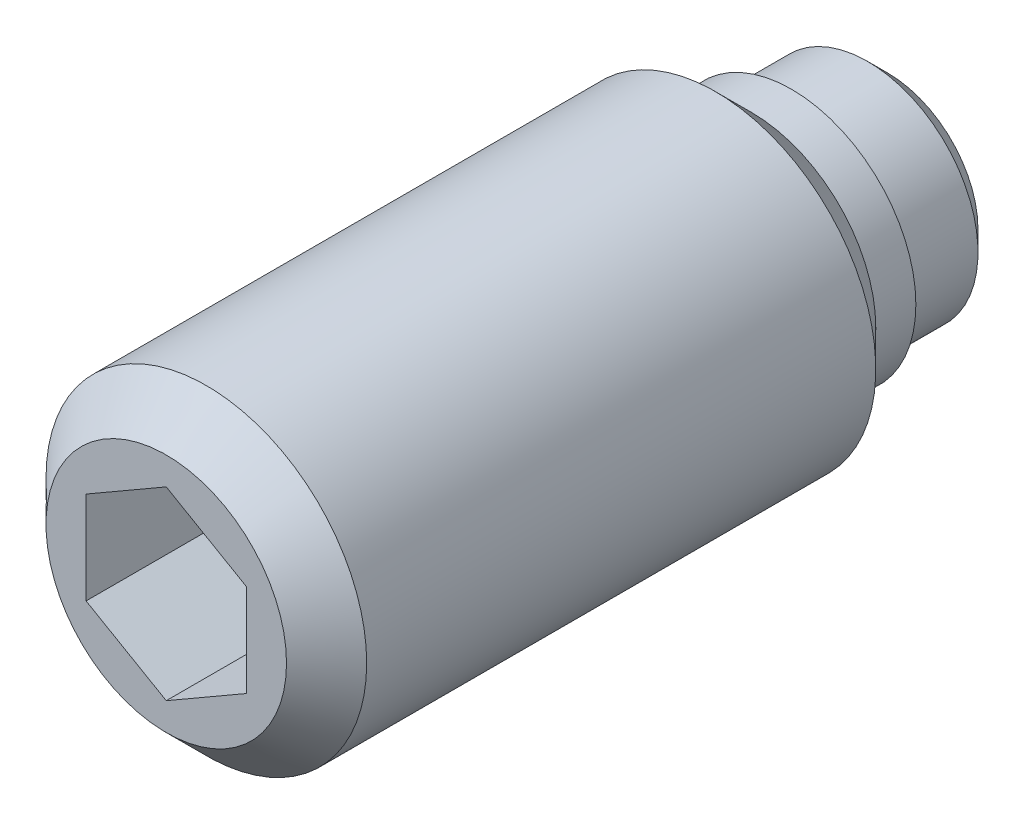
ISO-10303-21;
HEADER;
FILE_DESCRIPTION(('STEP AP214'),'2;1');
FILE_NAME('part.step','',(''),(''),'','','');
FILE_SCHEMA(('AUTOMOTIVE_DESIGN { 1 0 10303 214 1 1 1 1 }'));
ENDSEC;
DATA;
#1=APPLICATION_CONTEXT('core data for automotive mechanical design processes');
#2=APPLICATION_PROTOCOL_DEFINITION('international standard','automotive_design',2000,#1);
#3=PRODUCT_CONTEXT('',#1,'mechanical');
#4=PRODUCT('Part','Part','',(#3));
#5=PRODUCT_RELATED_PRODUCT_CATEGORY('part','',(#4));
#6=PRODUCT_DEFINITION_FORMATION('','',#4);
#7=PRODUCT_DEFINITION_CONTEXT('part definition',#1,'design');
#8=PRODUCT_DEFINITION('design','',#6,#7);
#9=PRODUCT_DEFINITION_SHAPE('','',#8);
#10=(LENGTH_UNIT() NAMED_UNIT(*) SI_UNIT(.MILLI.,.METRE.));
#11=(NAMED_UNIT(*) PLANE_ANGLE_UNIT() SI_UNIT($,.RADIAN.));
#12=(NAMED_UNIT(*) SI_UNIT($,.STERADIAN.) SOLID_ANGLE_UNIT());
#13=UNCERTAINTY_MEASURE_WITH_UNIT(LENGTH_MEASURE(1.E-05),#10,'distance_accuracy_value','');
#14=(GEOMETRIC_REPRESENTATION_CONTEXT(3) GLOBAL_UNCERTAINTY_ASSIGNED_CONTEXT((#13)) GLOBAL_UNIT_ASSIGNED_CONTEXT((#10,
#11,#12)) REPRESENTATION_CONTEXT('',''));
#15=CARTESIAN_POINT('',(0.,0.,0.));
#16=DIRECTION('',(0.,0.,1.));
#17=DIRECTION('',(1.,0.,0.));
#18=AXIS2_PLACEMENT_3D('',#15,#16,#17);
#19=CARTESIAN_POINT('',(0.,0.,2.4));
#20=DIRECTION('',(0.,0.,-1.));
#21=DIRECTION('',(-1.,0.,0.));
#22=AXIS2_PLACEMENT_3D('',#19,#20,#21);
#23=CYLINDRICAL_SURFACE('',#22,4.);
#24=CARTESIAN_POINT('',(0.,0.,17.));
#25=DIRECTION('',(0.,0.,1.));
#26=DIRECTION('',(1.,0.,0.));
#27=AXIS2_PLACEMENT_3D('',#24,#25,#26);
#28=CIRCLE('',#27,4.);
#29=CARTESIAN_POINT('',(4.,0.,17.));
#30=VERTEX_POINT('',#29);
#31=EDGE_CURVE('E9',#30,#30,#28,.F.);
#32=ORIENTED_EDGE('',*,*,#31,.T.);
#33=EDGE_LOOP('',(#32));
#34=FACE_BOUND('',#33,.T.);
#35=CARTESIAN_POINT('',(0.,0.,4.3));
#36=DIRECTION('',(0.,0.,-1.));
#37=DIRECTION('',(-1.,0.,0.));
#38=AXIS2_PLACEMENT_3D('',#35,#36,#37);
#39=CIRCLE('',#38,4.);
#40=CARTESIAN_POINT('',(-4.,0.,4.3));
#41=VERTEX_POINT('',#40);
#42=EDGE_CURVE('E74',#41,#41,#39,.T.);
#43=ORIENTED_EDGE('',*,*,#42,.F.);
#44=EDGE_LOOP('',(#43));
#45=FACE_BOUND('',#44,.T.);
#46=ADVANCED_FACE('F14',(#34,#45),#23,.T.);
#47=CARTESIAN_POINT('',(0.,0.,4.3));
#48=DIRECTION('',(0.,0.,1.));
#49=DIRECTION('',(1.,0.,0.));
#50=AXIS2_PLACEMENT_3D('',#47,#48,#49);
#51=CONICAL_SURFACE('',#50,4.,0.785398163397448);
#52=ORIENTED_EDGE('',*,*,#42,.T.);
#53=EDGE_LOOP('',(#52));
#54=FACE_BOUND('',#53,.T.);
#55=CARTESIAN_POINT('',(0.,0.,3.4));
#56=DIRECTION('',(0.,0.,-1.));
#57=DIRECTION('',(-1.,0.,0.));
#58=AXIS2_PLACEMENT_3D('',#55,#56,#57);
#59=CIRCLE('',#58,3.1);
#60=CARTESIAN_POINT('',(-3.1,0.,3.4));
#61=VERTEX_POINT('',#60);
#62=EDGE_CURVE('E112',#61,#61,#59,.T.);
#63=ORIENTED_EDGE('',*,*,#62,.F.);
#64=EDGE_LOOP('',(#63));
#65=FACE_BOUND('',#64,.T.);
#66=ADVANCED_FACE('F130',(#54,#65),#51,.T.);
#67=CARTESIAN_POINT('',(0.,0.,2.4));
#68=DIRECTION('',(0.,0.,-1.));
#69=DIRECTION('',(-1.,0.,0.));
#70=AXIS2_PLACEMENT_3D('',#67,#68,#69);
#71=CYLINDRICAL_SURFACE('',#70,3.1);
#72=ORIENTED_EDGE('',*,*,#62,.T.);
#73=EDGE_LOOP('',(#72));
#74=FACE_BOUND('',#73,.T.);
#75=CARTESIAN_POINT('',(0.,0.,2.4));
#76=DIRECTION('',(0.,0.,-1.));
#77=DIRECTION('',(-1.,0.,0.));
#78=AXIS2_PLACEMENT_3D('',#75,#76,#77);
#79=CIRCLE('',#78,3.1);
#80=CARTESIAN_POINT('',(-3.1,0.,2.4));
#81=VERTEX_POINT('',#80);
#82=EDGE_CURVE('E109',#81,#81,#79,.T.);
#83=ORIENTED_EDGE('',*,*,#82,.F.);
#84=EDGE_LOOP('',(#83));
#85=FACE_BOUND('',#84,.T.);
#86=ADVANCED_FACE('F135',(#74,#85),#71,.T.);
#87=CARTESIAN_POINT('',(0.,3.1,2.4));
#88=DIRECTION('',(0.,0.,1.));
#89=DIRECTION('',(1.,0.,0.));
#90=AXIS2_PLACEMENT_3D('',#87,#88,#89);
#91=PLANE('',#90);
#92=ORIENTED_EDGE('',*,*,#82,.T.);
#93=EDGE_LOOP('',(#92));
#94=FACE_BOUND('',#93,.T.);
#95=CARTESIAN_POINT('',(0.,0.,2.4));
#96=DIRECTION('',(0.,0.,-1.));
#97=DIRECTION('',(-1.,0.,0.));
#98=AXIS2_PLACEMENT_3D('',#95,#96,#97);
#99=CIRCLE('',#98,2.75);
#100=CARTESIAN_POINT('',(-2.75,0.,2.4));
#101=VERTEX_POINT('',#100);
#102=EDGE_CURVE('E106',#101,#101,#99,.T.);
#103=ORIENTED_EDGE('',*,*,#102,.F.);
#104=EDGE_LOOP('',(#103));
#105=FACE_BOUND('',#104,.T.);
#106=ADVANCED_FACE('F142',(#94,#105),#91,.F.);
#107=CARTESIAN_POINT('',(0.,0.,0.));
#108=DIRECTION('',(0.,0.,-1.));
#109=DIRECTION('',(-1.,0.,0.));
#110=AXIS2_PLACEMENT_3D('',#107,#108,#109);
#111=CYLINDRICAL_SURFACE('',#110,2.75);
#112=CARTESIAN_POINT('',(0.,0.,0.5));
#113=DIRECTION('',(0.,0.,-1.));
#114=DIRECTION('',(-1.,0.,0.));
#115=AXIS2_PLACEMENT_3D('',#112,#113,#114);
#116=CIRCLE('',#115,2.75);
#117=CARTESIAN_POINT('',(-2.75,0.,0.5));
#118=VERTEX_POINT('',#117);
#119=EDGE_CURVE('E103',#118,#118,#116,.T.);
#120=ORIENTED_EDGE('',*,*,#119,.F.);
#121=EDGE_LOOP('',(#120));
#122=FACE_BOUND('',#121,.T.);
#123=ORIENTED_EDGE('',*,*,#102,.T.);
#124=EDGE_LOOP('',(#123));
#125=FACE_BOUND('',#124,.T.);
#126=ADVANCED_FACE('F146',(#122,#125),#111,.T.);
#127=CARTESIAN_POINT('',(0.,0.,0.5));
#128=DIRECTION('',(0.,0.,1.));
#129=DIRECTION('',(1.,0.,0.));
#130=AXIS2_PLACEMENT_3D('',#127,#128,#129);
#131=CONICAL_SURFACE('',#130,2.75,0.785398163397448);
#132=CARTESIAN_POINT('',(0.,0.,0.));
#133=DIRECTION('',(0.,0.,-1.));
#134=DIRECTION('',(-1.,0.,0.));
#135=AXIS2_PLACEMENT_3D('',#132,#133,#134);
#136=CIRCLE('',#135,2.25);
#137=CARTESIAN_POINT('',(-2.25,0.,0.));
#138=VERTEX_POINT('',#137);
#139=EDGE_CURVE('E100',#138,#138,#136,.T.);
#140=ORIENTED_EDGE('',*,*,#139,.F.);
#141=EDGE_LOOP('',(#140));
#142=FACE_BOUND('',#141,.T.);
#143=ORIENTED_EDGE('',*,*,#119,.T.);
#144=EDGE_LOOP('',(#143));
#145=FACE_BOUND('',#144,.T.);
#146=ADVANCED_FACE('F150',(#142,#145),#131,.T.);
#147=CARTESIAN_POINT('',(0.,2.25,0.));
#148=DIRECTION('',(0.,0.,1.));
#149=DIRECTION('',(1.,0.,0.));
#150=AXIS2_PLACEMENT_3D('',#147,#148,#149);
#151=PLANE('',#150);
#152=ORIENTED_EDGE('',*,*,#139,.T.);
#153=EDGE_LOOP('',(#152));
#154=FACE_BOUND('',#153,.T.);
#155=ADVANCED_FACE('F154',(#154),#151,.F.);
#156=CARTESIAN_POINT('',(0.,0.,18.));
#157=DIRECTION('',(0.,0.,1.));
#158=DIRECTION('',(1.,0.,0.));
#159=AXIS2_PLACEMENT_3D('',#156,#157,#158);
#160=PLANE('',#159);
#161=CARTESIAN_POINT('',(0.,0.,18.));
#162=DIRECTION('',(0.,0.,1.));
#163=DIRECTION('',(1.,0.,0.));
#164=AXIS2_PLACEMENT_3D('',#161,#162,#163);
#165=CIRCLE('',#164,3.);
#166=CARTESIAN_POINT('',(3.,0.,18.));
#167=VERTEX_POINT('',#166);
#168=EDGE_CURVE('E22',#167,#167,#165,.T.);
#169=ORIENTED_EDGE('',*,*,#168,.T.);
#170=EDGE_LOOP('',(#169));
#171=FACE_BOUND('',#170,.T.);
#172=DIRECTION('',(-0.866025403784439,0.5,0.));
#173=VECTOR('',#172,1.);
#174=CARTESIAN_POINT('',(-2.,-1.15470053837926,18.));
#175=LINE('',#174,#173);
#176=CARTESIAN_POINT('',(0.,-2.30940107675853,18.));
#177=VERTEX_POINT('',#176);
#178=CARTESIAN_POINT('',(-2.,-1.15470053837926,18.));
#179=VERTEX_POINT('',#178);
#180=EDGE_CURVE('E69',#177,#179,#175,.T.);
#181=ORIENTED_EDGE('',*,*,#180,.T.);
#182=DIRECTION('',(0.,1.,0.));
#183=VECTOR('',#182,1.);
#184=CARTESIAN_POINT('',(-2.,1.15470053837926,18.));
#185=LINE('',#184,#183);
#186=CARTESIAN_POINT('',(-2.,1.15470053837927,18.));
#187=VERTEX_POINT('',#186);
#188=EDGE_CURVE('E84',#179,#187,#185,.T.);
#189=ORIENTED_EDGE('',*,*,#188,.T.);
#190=DIRECTION('',(0.866025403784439,0.5,0.));
#191=VECTOR('',#190,1.);
#192=CARTESIAN_POINT('',(0.,2.30940107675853,18.));
#193=LINE('',#192,#191);
#194=CARTESIAN_POINT('',(0.,2.30940107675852,18.));
#195=VERTEX_POINT('',#194);
#196=EDGE_CURVE('E300',#187,#195,#193,.T.);
#197=ORIENTED_EDGE('',*,*,#196,.T.);
#198=DIRECTION('',(0.866025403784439,-0.5,0.));
#199=VECTOR('',#198,1.);
#200=CARTESIAN_POINT('',(2.,1.15470053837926,18.));
#201=LINE('',#200,#199);
#202=CARTESIAN_POINT('',(2.,1.15470053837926,18.));
#203=VERTEX_POINT('',#202);
#204=EDGE_CURVE('E297',#195,#203,#201,.T.);
#205=ORIENTED_EDGE('',*,*,#204,.T.);
#206=DIRECTION('',(0.,-1.,0.));
#207=VECTOR('',#206,1.);
#208=CARTESIAN_POINT('',(2.,-1.15470053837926,18.));
#209=LINE('',#208,#207);
#210=CARTESIAN_POINT('',(2.,-1.15470053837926,18.));
#211=VERTEX_POINT('',#210);
#212=EDGE_CURVE('E29',#203,#211,#209,.T.);
#213=ORIENTED_EDGE('',*,*,#212,.T.);
#214=DIRECTION('',(-0.866025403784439,-0.5,0.));
#215=VECTOR('',#214,1.);
#216=CARTESIAN_POINT('',(0.,-2.30940107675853,18.));
#217=LINE('',#216,#215);
#218=EDGE_CURVE('E66',#211,#177,#217,.T.);
#219=ORIENTED_EDGE('',*,*,#218,.T.);
#220=EDGE_LOOP('',(#181,#189,#197,#205,#213,#219));
#221=FACE_BOUND('',#220,.T.);
#222=ADVANCED_FACE('F68',(#171,#221),#160,.T.);
#223=CARTESIAN_POINT('',(0.,0.,13.));
#224=DIRECTION('',(0.,0.,1.));
#225=DIRECTION('',(1.,0.,0.));
#226=AXIS2_PLACEMENT_3D('',#223,#224,#225);
#227=PLANE('',#226);
#228=DIRECTION('',(-0.866025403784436,-0.5,0.));
#229=VECTOR('',#228,1.);
#230=CARTESIAN_POINT('',(0.,2.30940107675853,13.));
#231=LINE('',#230,#229);
#232=CARTESIAN_POINT('',(0.,2.30940107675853,13.));
#233=VERTEX_POINT('',#232);
#234=CARTESIAN_POINT('',(-2.,1.15470053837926,13.));
#235=VERTEX_POINT('',#234);
#236=EDGE_CURVE('E83',#233,#235,#231,.T.);
#237=ORIENTED_EDGE('',*,*,#236,.T.);
#238=DIRECTION('',(0.,-1.,0.));
#239=VECTOR('',#238,1.);
#240=CARTESIAN_POINT('',(-2.,1.15470053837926,13.));
#241=LINE('',#240,#239);
#242=CARTESIAN_POINT('',(-2.,-1.15470053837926,13.));
#243=VERTEX_POINT('',#242);
#244=EDGE_CURVE('E282',#235,#243,#241,.T.);
#245=ORIENTED_EDGE('',*,*,#244,.T.);
#246=DIRECTION('',(0.866025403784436,-0.5,0.));
#247=VECTOR('',#246,1.);
#248=CARTESIAN_POINT('',(-2.,-1.15470053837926,13.));
#249=LINE('',#248,#247);
#250=CARTESIAN_POINT('',(0.,-2.30940107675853,13.));
#251=VERTEX_POINT('',#250);
#252=EDGE_CURVE('E285',#243,#251,#249,.T.);
#253=ORIENTED_EDGE('',*,*,#252,.T.);
#254=DIRECTION('',(0.866025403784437,0.5,0.));
#255=VECTOR('',#254,1.);
#256=CARTESIAN_POINT('',(0.,-2.30940107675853,13.));
#257=LINE('',#256,#255);
#258=CARTESIAN_POINT('',(2.,-1.15470053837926,13.));
#259=VERTEX_POINT('',#258);
#260=EDGE_CURVE('E88',#251,#259,#257,.T.);
#261=ORIENTED_EDGE('',*,*,#260,.T.);
#262=DIRECTION('',(0.,1.,0.));
#263=VECTOR('',#262,1.);
#264=CARTESIAN_POINT('',(2.,-1.15470053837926,13.));
#265=LINE('',#264,#263);
#266=CARTESIAN_POINT('',(2.,1.15470053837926,13.));
#267=VERTEX_POINT('',#266);
#268=EDGE_CURVE('E96',#259,#267,#265,.T.);
#269=ORIENTED_EDGE('',*,*,#268,.T.);
#270=DIRECTION('',(-0.866025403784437,0.5,0.));
#271=VECTOR('',#270,1.);
#272=CARTESIAN_POINT('',(2.,1.15470053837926,13.));
#273=LINE('',#272,#271);
#274=EDGE_CURVE('E91',#267,#233,#273,.T.);
#275=ORIENTED_EDGE('',*,*,#274,.T.);
#276=EDGE_LOOP('',(#237,#245,#253,#261,#269,#275));
#277=FACE_BOUND('',#276,.T.);
#278=ADVANCED_FACE('F162',(#277),#227,.T.);
#279=CARTESIAN_POINT('',(0.,-2.30940107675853,29.));
#280=DIRECTION('',(0.5,-0.866025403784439,0.));
#281=DIRECTION('',(0.866025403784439,0.5,0.));
#282=AXIS2_PLACEMENT_3D('',#279,#280,#281);
#283=PLANE('',#282);
#284=ORIENTED_EDGE('',*,*,#218,.F.);
#285=DIRECTION('',(0.,0.,1.));
#286=VECTOR('',#285,1.);
#287=CARTESIAN_POINT('',(2.,-1.15470053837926,29.));
#288=LINE('',#287,#286);
#289=EDGE_CURVE('E90',#259,#211,#288,.T.);
#290=ORIENTED_EDGE('',*,*,#289,.F.);
#291=ORIENTED_EDGE('',*,*,#260,.F.);
#292=DIRECTION('',(0.,0.,1.));
#293=VECTOR('',#292,1.);
#294=CARTESIAN_POINT('',(0.,-2.30940107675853,29.));
#295=LINE('',#294,#293);
#296=EDGE_CURVE('E80',#251,#177,#295,.T.);
#297=ORIENTED_EDGE('',*,*,#296,.T.);
#298=EDGE_LOOP('',(#284,#290,#291,#297));
#299=FACE_BOUND('',#298,.T.);
#300=ADVANCED_FACE('F86',(#299),#283,.F.);
#301=CARTESIAN_POINT('',(2.,-1.15470053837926,29.));
#302=DIRECTION('',(1.,0.,0.));
#303=DIRECTION('',(0.,0.,-1.));
#304=AXIS2_PLACEMENT_3D('',#301,#302,#303);
#305=PLANE('',#304);
#306=ORIENTED_EDGE('',*,*,#212,.F.);
#307=DIRECTION('',(0.,0.,1.));
#308=VECTOR('',#307,1.);
#309=CARTESIAN_POINT('',(2.,1.15470053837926,29.));
#310=LINE('',#309,#308);
#311=EDGE_CURVE('E93',#267,#203,#310,.T.);
#312=ORIENTED_EDGE('',*,*,#311,.F.);
#313=ORIENTED_EDGE('',*,*,#268,.F.);
#314=ORIENTED_EDGE('',*,*,#289,.T.);
#315=EDGE_LOOP('',(#306,#312,#313,#314));
#316=FACE_BOUND('',#315,.T.);
#317=ADVANCED_FACE('F161',(#316),#305,.F.);
#318=CARTESIAN_POINT('',(2.,1.15470053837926,29.));
#319=DIRECTION('',(0.5,0.866025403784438,0.));
#320=DIRECTION('',(-0.866025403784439,0.5,0.));
#321=AXIS2_PLACEMENT_3D('',#318,#319,#320);
#322=PLANE('',#321);
#323=ORIENTED_EDGE('',*,*,#204,.F.);
#324=DIRECTION('',(0.,0.,1.));
#325=VECTOR('',#324,1.);
#326=CARTESIAN_POINT('',(0.,2.30940107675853,29.));
#327=LINE('',#326,#325);
#328=EDGE_CURVE('E37',#233,#195,#327,.T.);
#329=ORIENTED_EDGE('',*,*,#328,.F.);
#330=ORIENTED_EDGE('',*,*,#274,.F.);
#331=ORIENTED_EDGE('',*,*,#311,.T.);
#332=EDGE_LOOP('',(#323,#329,#330,#331));
#333=FACE_BOUND('',#332,.T.);
#334=ADVANCED_FACE('F165',(#333),#322,.F.);
#335=CARTESIAN_POINT('',(0.,2.30940107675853,29.));
#336=DIRECTION('',(-0.5,0.866025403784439,0.));
#337=DIRECTION('',(-0.866025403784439,-0.5,0.));
#338=AXIS2_PLACEMENT_3D('',#335,#336,#337);
#339=PLANE('',#338);
#340=ORIENTED_EDGE('',*,*,#196,.F.);
#341=DIRECTION('',(0.,0.,1.));
#342=VECTOR('',#341,1.);
#343=CARTESIAN_POINT('',(-2.,1.15470053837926,29.));
#344=LINE('',#343,#342);
#345=EDGE_CURVE('E293',#235,#187,#344,.T.);
#346=ORIENTED_EDGE('',*,*,#345,.F.);
#347=ORIENTED_EDGE('',*,*,#236,.F.);
#348=ORIENTED_EDGE('',*,*,#328,.T.);
#349=EDGE_LOOP('',(#340,#346,#347,#348));
#350=FACE_BOUND('',#349,.T.);
#351=ADVANCED_FACE('F169',(#350),#339,.F.);
#352=CARTESIAN_POINT('',(-2.,1.15470053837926,29.));
#353=DIRECTION('',(-1.,0.,0.));
#354=DIRECTION('',(0.,0.,1.));
#355=AXIS2_PLACEMENT_3D('',#352,#353,#354);
#356=PLANE('',#355);
#357=ORIENTED_EDGE('',*,*,#188,.F.);
#358=DIRECTION('',(0.,0.,1.));
#359=VECTOR('',#358,1.);
#360=CARTESIAN_POINT('',(-2.,-1.15470053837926,29.));
#361=LINE('',#360,#359);
#362=EDGE_CURVE('E82',#243,#179,#361,.T.);
#363=ORIENTED_EDGE('',*,*,#362,.F.);
#364=ORIENTED_EDGE('',*,*,#244,.F.);
#365=ORIENTED_EDGE('',*,*,#345,.T.);
#366=EDGE_LOOP('',(#357,#363,#364,#365));
#367=FACE_BOUND('',#366,.T.);
#368=ADVANCED_FACE('F126',(#367),#356,.F.);
#369=CARTESIAN_POINT('',(-2.,-1.15470053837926,29.));
#370=DIRECTION('',(-0.5,-0.866025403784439,0.));
#371=DIRECTION('',(0.866025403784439,-0.5,0.));
#372=AXIS2_PLACEMENT_3D('',#369,#370,#371);
#373=PLANE('',#372);
#374=ORIENTED_EDGE('',*,*,#180,.F.);
#375=ORIENTED_EDGE('',*,*,#296,.F.);
#376=ORIENTED_EDGE('',*,*,#252,.F.);
#377=ORIENTED_EDGE('',*,*,#362,.T.);
#378=EDGE_LOOP('',(#374,#375,#376,#377));
#379=FACE_BOUND('',#378,.T.);
#380=ADVANCED_FACE('F78',(#379),#373,.F.);
#381=CARTESIAN_POINT('',(0.,0.,18.));
#382=DIRECTION('',(0.,0.,-1.));
#383=DIRECTION('',(-1.,0.,0.));
#384=AXIS2_PLACEMENT_3D('',#381,#382,#383);
#385=CONICAL_SURFACE('',#384,3.,0.785398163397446);
#386=ORIENTED_EDGE('',*,*,#31,.F.);
#387=EDGE_LOOP('',(#386));
#388=FACE_BOUND('',#387,.T.);
#389=ORIENTED_EDGE('',*,*,#168,.F.);
#390=EDGE_LOOP('',(#389));
#391=FACE_BOUND('',#390,.T.);
#392=ADVANCED_FACE('F16',(#388,#391),#385,.T.);
#393=CLOSED_SHELL('',(#46,#66,#86,#106,#126,#146,#155,#222,#278,#300,#317,#334,#351,#368,#380,#392));
#394=MANIFOLD_SOLID_BREP('B1',#393);
#395=ADVANCED_BREP_SHAPE_REPRESENTATION('',(#18,#394),#14);
#396=SHAPE_DEFINITION_REPRESENTATION(#9,#395);
ENDSEC;
END-ISO-10303-21;
